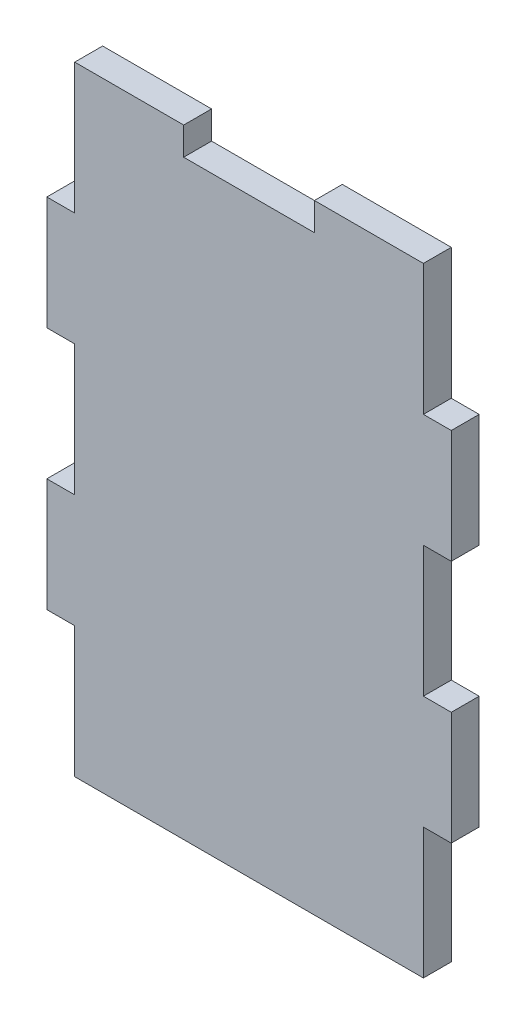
from build123d import *

# Parameters (mm, degrees)
BOSS_EXTRUDE1_DEPTH = 16


with BuildPart() as part:
    # Sketch1 → Boss-Extrude1 (new body)
    with BuildSketch(Plane.XY):
        Polygon((78.5, 355), (16, 355), (16, 280), (0, 280), (0, 215), (16, 215), (16, 140), (0, 140), (0, 75), (16, 75), (16, 0), (216, 0), (216, 75), (232, 75), (232, 140), (216, 140), (216, 215), (232, 215), (232, 280), (216, 280), (216, 355), (153.5, 355), (153.5, 339), (78.5, 339), align=None)
    extrude(amount=BOSS_EXTRUDE1_DEPTH)


solid = part.part
